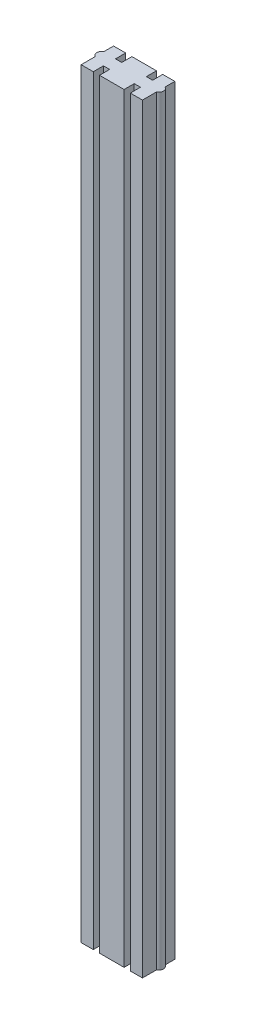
from build123d import *

# Parameters (mm, degrees)
BOSS_EXTRUDE1_DEPTH = 495.0079


with BuildPart() as part:
    # Sketch1 → Boss-Extrude1 (new body)
    with BuildSketch(Plane(origin=(0, 0, 0), x_dir=(1, 0, 0), z_dir=(0, 1, 0))):
        with BuildLine():
            Line((0, 0), (7.874, 0))
            Line((7.874, 0), (7.874, 6.604))
            Line((7.874, 6.604), (11.938, 6.604))
            Line((11.938, 6.604), (11.938, 0))
            Line((11.938, 0), (27.94, 0))
            Line((27.94, 0), (27.94, 6.604))
            Line((27.94, 6.604), (32.004, 6.604))
            Line((32.004, 6.604), (32.004, 0))
            Line((32.004, 0), (39.878, 0))
            Line((39.878, 0), (39.878, 9.167187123))
            ThreePointArc((39.878, 9.167187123), (41.656, 11.938), (39.878, 14.708812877))
            Line((39.878, 14.708812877), (39.878, 21.082))
            Line((39.878, 21.082), (32.004, 21.082))
            Line((32.004, 21.082), (32.004, 14.478))
            Line((32.004, 14.478), (27.94, 14.478))
            Line((27.94, 14.478), (27.94, 21.082))
            Line((27.94, 21.082), (11.938, 21.082))
            Line((11.938, 21.082), (11.938, 14.478))
            Line((11.938, 14.478), (7.874, 14.478))
            Line((7.874, 14.478), (7.874, 21.082))
            Line((7.874, 21.082), (0, 21.082))
            Line((0, 21.082), (0, 14.708812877))
            ThreePointArc((0, 14.708812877), (-1.778, 11.938), (0, 9.167187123))
            Line((0, 9.167187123), (0, 0))
        make_face()
    extrude(amount=BOSS_EXTRUDE1_DEPTH)


solid = part.part
